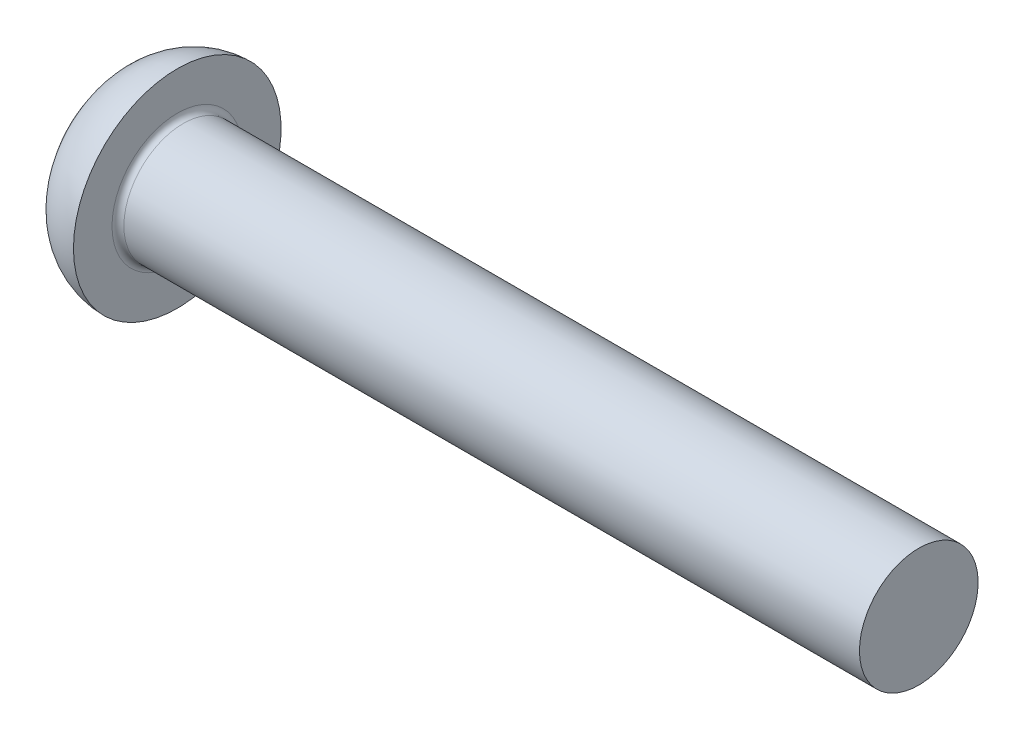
ISO-10303-21;
HEADER;
FILE_DESCRIPTION(('STEP AP214'),'2;1');
FILE_NAME('part.step','',(''),(''),'','','');
FILE_SCHEMA(('AUTOMOTIVE_DESIGN { 1 0 10303 214 1 1 1 1 }'));
ENDSEC;
DATA;
#1=APPLICATION_CONTEXT('core data for automotive mechanical design processes');
#2=APPLICATION_PROTOCOL_DEFINITION('international standard','automotive_design',2000,#1);
#3=PRODUCT_CONTEXT('',#1,'mechanical');
#4=PRODUCT('Part','Part','',(#3));
#5=PRODUCT_RELATED_PRODUCT_CATEGORY('part','',(#4));
#6=PRODUCT_DEFINITION_FORMATION('','',#4);
#7=PRODUCT_DEFINITION_CONTEXT('part definition',#1,'design');
#8=PRODUCT_DEFINITION('design','',#6,#7);
#9=PRODUCT_DEFINITION_SHAPE('','',#8);
#10=(LENGTH_UNIT() NAMED_UNIT(*) SI_UNIT(.MILLI.,.METRE.));
#11=(NAMED_UNIT(*) PLANE_ANGLE_UNIT() SI_UNIT($,.RADIAN.));
#12=(NAMED_UNIT(*) SI_UNIT($,.STERADIAN.) SOLID_ANGLE_UNIT());
#13=UNCERTAINTY_MEASURE_WITH_UNIT(LENGTH_MEASURE(1.E-05),#10,'distance_accuracy_value','');
#14=(GEOMETRIC_REPRESENTATION_CONTEXT(3) GLOBAL_UNCERTAINTY_ASSIGNED_CONTEXT((#13)) GLOBAL_UNIT_ASSIGNED_CONTEXT((#10,
#11,#12)) REPRESENTATION_CONTEXT('',''));
#15=CARTESIAN_POINT('',(0.,0.,0.));
#16=DIRECTION('',(0.,0.,1.));
#17=DIRECTION('',(1.,0.,0.));
#18=AXIS2_PLACEMENT_3D('',#15,#16,#17);
#19=CARTESIAN_POINT('',(8.4,0.,0.));
#20=DIRECTION('',(-1.,0.,0.));
#21=DIRECTION('',(0.,1.,0.));
#22=AXIS2_PLACEMENT_3D('',#19,#20,#21);
#23=SPHERICAL_SURFACE('',#22,8.4);
#24=CARTESIAN_POINT('',(1.88795521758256,0.,0.));
#25=DIRECTION('',(-1.,0.,0.));
#26=DIRECTION('',(0.,0.,1.));
#27=AXIS2_PLACEMENT_3D('',#24,#25,#26);
#28=CIRCLE('',#27,5.30596576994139);
#29=CARTESIAN_POINT('',(1.88795521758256,0.,5.30596576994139));
#30=VERTEX_POINT('',#29);
#31=EDGE_CURVE('E873',#30,#30,#28,.T.);
#32=ORIENTED_EDGE('',*,*,#31,.T.);
#33=EDGE_LOOP('',(#32));
#34=FACE_BOUND('',#33,.T.);
#35=CARTESIAN_POINT('',(0.206025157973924,0.,0.));
#36=DIRECTION('',(1.,0.,0.));
#37=DIRECTION('',(0.,0.,-1.));
#38=AXIS2_PLACEMENT_3D('',#35,#36,#37);
#39=CIRCLE('',#38,1.84899331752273);
#40=CARTESIAN_POINT('',(0.206025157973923,-0.846999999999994,-1.64358367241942));
#41=VERTEX_POINT('',#40);
#42=CARTESIAN_POINT('',(0.206025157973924,-1.64358367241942,-0.847));
#43=VERTEX_POINT('',#42);
#44=EDGE_CURVE('E628',#41,#43,#39,.F.);
#45=ORIENTED_EDGE('',*,*,#44,.F.);
#46=CARTESIAN_POINT('',(8.4,-0.847,0.));
#47=DIRECTION('',(0.,1.,0.));
#48=DIRECTION('',(0.,0.,1.));
#49=AXIS2_PLACEMENT_3D('',#46,#47,#48);
#50=CIRCLE('',#49,8.35718798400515);
#51=CARTESIAN_POINT('',(0.790764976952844,-0.846999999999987,-3.45573919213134));
#52=VERTEX_POINT('',#51);
#53=EDGE_CURVE('E537',#52,#41,#50,.T.);
#54=ORIENTED_EDGE('',*,*,#53,.F.);
#55=CARTESIAN_POINT('',(8.26499674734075,0.,0.270774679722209));
#56=DIRECTION('',(-0.446197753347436,0.,0.894934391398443));
#57=DIRECTION('',(0.894934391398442,0.,0.446197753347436));
#58=AXIS2_PLACEMENT_3D('',#55,#56,#57);
#59=CIRCLE('',#58,8.3945491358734);
#60=CARTESIAN_POINT('',(0.790764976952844,0.847000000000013,-3.45573919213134));
#61=VERTEX_POINT('',#60);
#62=EDGE_CURVE('E67',#61,#52,#59,.T.);
#63=ORIENTED_EDGE('',*,*,#62,.F.);
#64=CARTESIAN_POINT('',(8.4,0.846999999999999,0.));
#65=DIRECTION('',(0.,-1.,0.));
#66=DIRECTION('',(0.,0.,-1.));
#67=AXIS2_PLACEMENT_3D('',#64,#65,#66);
#68=CIRCLE('',#67,8.35718798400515);
#69=CARTESIAN_POINT('',(0.206025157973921,0.847000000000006,-1.64358367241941));
#70=VERTEX_POINT('',#69);
#71=EDGE_CURVE('E529',#70,#61,#68,.T.);
#72=ORIENTED_EDGE('',*,*,#71,.F.);
#73=CARTESIAN_POINT('',(0.206025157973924,1.64358367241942,-0.847));
#74=VERTEX_POINT('',#73);
#75=EDGE_CURVE('E369',#74,#70,#39,.F.);
#76=ORIENTED_EDGE('',*,*,#75,.F.);
#77=CARTESIAN_POINT('',(8.4,0.,-0.846999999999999));
#78=DIRECTION('',(0.,0.,1.));
#79=DIRECTION('',(0.,-1.,0.));
#80=AXIS2_PLACEMENT_3D('',#77,#78,#79);
#81=CIRCLE('',#80,8.35718798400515);
#82=CARTESIAN_POINT('',(0.790764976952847,3.45573919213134,-0.846999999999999));
#83=VERTEX_POINT('',#82);
#84=EDGE_CURVE('E643',#83,#74,#81,.T.);
#85=ORIENTED_EDGE('',*,*,#84,.F.);
#86=CARTESIAN_POINT('',(8.26499674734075,-0.270774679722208,0.));
#87=DIRECTION('',(-0.446197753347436,-0.894934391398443,0.));
#88=DIRECTION('',(0.894934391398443,-0.446197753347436,0.));
#89=AXIS2_PLACEMENT_3D('',#86,#87,#88);
#90=CIRCLE('',#89,8.3945491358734);
#91=CARTESIAN_POINT('',(0.790764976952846,3.45573919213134,0.847000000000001));
#92=VERTEX_POINT('',#91);
#93=EDGE_CURVE('E644',#92,#83,#90,.T.);
#94=ORIENTED_EDGE('',*,*,#93,.F.);
#95=CARTESIAN_POINT('',(8.4,0.,0.847));
#96=DIRECTION('',(0.,0.,-1.));
#97=DIRECTION('',(0.,1.,0.));
#98=AXIS2_PLACEMENT_3D('',#95,#96,#97);
#99=CIRCLE('',#98,8.35718798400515);
#100=CARTESIAN_POINT('',(0.206025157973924,1.64358367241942,0.847));
#101=VERTEX_POINT('',#100);
#102=EDGE_CURVE('E83',#101,#92,#99,.T.);
#103=ORIENTED_EDGE('',*,*,#102,.F.);
#104=CARTESIAN_POINT('',(0.206025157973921,0.846999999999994,1.64358367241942));
#105=VERTEX_POINT('',#104);
#106=EDGE_CURVE('E605',#105,#101,#39,.F.);
#107=ORIENTED_EDGE('',*,*,#106,.F.);
#108=CARTESIAN_POINT('',(0.790764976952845,0.846999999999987,3.45573919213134));
#109=VERTEX_POINT('',#108);
#110=EDGE_CURVE('E541',#109,#105,#68,.T.);
#111=ORIENTED_EDGE('',*,*,#110,.F.);
#112=CARTESIAN_POINT('',(8.26499674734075,0.,-0.270774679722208));
#113=DIRECTION('',(-0.446197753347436,0.,-0.894934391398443));
#114=DIRECTION('',(-0.894934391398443,0.,0.446197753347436));
#115=AXIS2_PLACEMENT_3D('',#112,#113,#114);
#116=CIRCLE('',#115,8.3945491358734);
#117=CARTESIAN_POINT('',(0.790764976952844,-0.847000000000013,3.45573919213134));
#118=VERTEX_POINT('',#117);
#119=EDGE_CURVE('E655',#118,#109,#116,.T.);
#120=ORIENTED_EDGE('',*,*,#119,.F.);
#121=CARTESIAN_POINT('',(0.206025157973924,-0.847000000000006,1.64358367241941));
#122=VERTEX_POINT('',#121);
#123=EDGE_CURVE('E540',#122,#118,#50,.T.);
#124=ORIENTED_EDGE('',*,*,#123,.F.);
#125=CARTESIAN_POINT('',(0.206025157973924,-1.64358367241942,0.847));
#126=VERTEX_POINT('',#125);
#127=EDGE_CURVE('E625',#126,#122,#39,.F.);
#128=ORIENTED_EDGE('',*,*,#127,.F.);
#129=CARTESIAN_POINT('',(0.790764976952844,-3.45573919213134,0.846999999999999));
#130=VERTEX_POINT('',#129);
#131=EDGE_CURVE('E651',#130,#126,#99,.T.);
#132=ORIENTED_EDGE('',*,*,#131,.F.);
#133=CARTESIAN_POINT('',(8.26499674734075,0.270774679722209,0.));
#134=DIRECTION('',(-0.446197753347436,0.894934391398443,0.));
#135=DIRECTION('',(-0.894934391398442,-0.446197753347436,0.));
#136=AXIS2_PLACEMENT_3D('',#133,#134,#135);
#137=CIRCLE('',#136,8.3945491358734);
#138=CARTESIAN_POINT('',(0.790764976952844,-3.45573919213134,-0.847000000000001));
#139=VERTEX_POINT('',#138);
#140=EDGE_CURVE('E642',#139,#130,#137,.T.);
#141=ORIENTED_EDGE('',*,*,#140,.F.);
#142=EDGE_CURVE('E640',#43,#139,#81,.T.);
#143=ORIENTED_EDGE('',*,*,#142,.F.);
#144=EDGE_LOOP('',(#45,#54,#63,#72,#76,#85,#94,#103,#107,#111,#120,#124,#128,#132,#141,#143));
#145=FACE_BOUND('',#144,.T.);
#146=ADVANCED_FACE('F57',(#34,#145),#23,.T.);
#147=CARTESIAN_POINT('',(0.,-3.85,0.846999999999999));
#148=DIRECTION('',(0.,0.,-1.));
#149=DIRECTION('',(0.,1.,0.));
#150=AXIS2_PLACEMENT_3D('',#147,#148,#149);
#151=PLANE('',#150);
#152=ORIENTED_EDGE('',*,*,#131,.T.);
#153=CARTESIAN_POINT('',(0.0856194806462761,-1.65304981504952,0.847));
#154=CARTESIAN_POINT('',(0.662605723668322,-1.60769205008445,0.847));
#155=CARTESIAN_POINT('',(1.23956569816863,-1.56199038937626,0.847));
#156=CARTESIAN_POINT('',(2.39340338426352,-1.46957892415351,0.847));
#157=CARTESIAN_POINT('',(2.97028109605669,-1.42286912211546,0.847));
#158=CARTESIAN_POINT('',(3.78481241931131,-1.35597212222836,0.847));
#159=CARTESIAN_POINT('',(4.02251133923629,-1.33633645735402,0.847));
#160=CARTESIAN_POINT('',(4.2602,-1.31657675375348,0.847));
#161=B_SPLINE_CURVE_WITH_KNOTS('',3,(#153,#154,#155,#156,#157,#158,#159,#160),.UNSPECIFIED.,.F.,
.F.,(4,2,2,4),(0.,1.73630010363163,3.47259594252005,4.18812157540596),.UNSPECIFIED.);
#162=CARTESIAN_POINT('',(4.26,-1.31659338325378,0.847));
#163=VERTEX_POINT('',#162);
#164=EDGE_CURVE('E629',#126,#163,#161,.T.);
#165=ORIENTED_EDGE('',*,*,#164,.T.);
#166=DIRECTION('',(0.,-1.,0.));
#167=VECTOR('',#166,1.);
#168=CARTESIAN_POINT('',(4.26,1.72604270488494,0.847000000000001));
#169=LINE('',#168,#167);
#170=CARTESIAN_POINT('',(4.26,-1.72604270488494,0.847));
#171=VERTEX_POINT('',#170);
#172=EDGE_CURVE('E418',#163,#171,#169,.T.);
#173=ORIENTED_EDGE('',*,*,#172,.T.);
#174=DIRECTION('',(0.894934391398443,0.446197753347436,0.));
#175=VECTOR('',#174,1.);
#176=CARTESIAN_POINT('',(0.,-3.85,0.846999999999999));
#177=LINE('',#176,#175);
#178=EDGE_CURVE('E553',#130,#171,#177,.T.);
#179=ORIENTED_EDGE('',*,*,#178,.F.);
#180=EDGE_LOOP('',(#152,#165,#173,#179));
#181=FACE_BOUND('',#180,.T.);
#182=ADVANCED_FACE('F187',(#181),#151,.T.);
#183=CARTESIAN_POINT('',(4.26,1.72604270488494,0.847000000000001));
#184=VERTEX_POINT('',#183);
#185=CARTESIAN_POINT('',(4.26,1.31659338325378,0.847));
#186=VERTEX_POINT('',#185);
#187=EDGE_CURVE('E572',#184,#186,#169,.T.);
#188=ORIENTED_EDGE('',*,*,#187,.T.);
#189=CARTESIAN_POINT('',(4.2602,1.31657675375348,0.847000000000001));
#190=CARTESIAN_POINT('',(3.77406971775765,1.35698413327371,0.847000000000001));
#191=CARTESIAN_POINT('',(3.28789704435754,1.39687738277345,0.847));
#192=CARTESIAN_POINT('',(2.31548422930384,1.47582372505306,0.847));
#193=CARTESIAN_POINT('',(1.82924408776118,1.5148768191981,0.847));
#194=CARTESIAN_POINT('',(1.13342746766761,1.57029295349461,0.847));
#195=CARTESIAN_POINT('',(0.923872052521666,1.58692142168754,0.847));
#196=CARTESIAN_POINT('',(0.504752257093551,1.62006685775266,0.847));
#197=CARTESIAN_POINT('',(0.295187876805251,1.63658382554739,0.847));
#198=CARTESIAN_POINT('',(0.0856194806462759,1.65304981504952,0.847));
#199=B_SPLINE_CURVE_WITH_KNOTS('',3,(#189,#190,#191,#192,#193,#194,#195,#196,#197,#198),
.UNSPECIFIED.,.F.,.F.,(4,2,2,2,4),(0.,1.46341944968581,2.92683652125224,3.55747887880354,
4.18812167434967),.UNSPECIFIED.);
#200=EDGE_CURVE('E624',#186,#101,#199,.T.);
#201=ORIENTED_EDGE('',*,*,#200,.T.);
#202=ORIENTED_EDGE('',*,*,#102,.T.);
#203=DIRECTION('',(0.894934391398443,-0.446197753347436,0.));
#204=VECTOR('',#203,1.);
#205=CARTESIAN_POINT('',(0.,3.85,0.847000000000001));
#206=LINE('',#205,#204);
#207=EDGE_CURVE('E550',#92,#184,#206,.T.);
#208=ORIENTED_EDGE('',*,*,#207,.T.);
#209=EDGE_LOOP('',(#188,#201,#202,#208));
#210=FACE_BOUND('',#209,.T.);
#211=ADVANCED_FACE('F193',(#210),#151,.T.);
#212=CARTESIAN_POINT('',(0.,3.85,-0.846999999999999));
#213=DIRECTION('',(0.,0.,1.));
#214=DIRECTION('',(0.,-1.,0.));
#215=AXIS2_PLACEMENT_3D('',#212,#213,#214);
#216=PLANE('',#215);
#217=DIRECTION('',(0.,1.,0.));
#218=VECTOR('',#217,1.);
#219=CARTESIAN_POINT('',(4.26,1.72604270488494,-0.846999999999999));
#220=LINE('',#219,#218);
#221=CARTESIAN_POINT('',(4.26,-1.72604270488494,-0.846999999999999));
#222=VERTEX_POINT('',#221);
#223=CARTESIAN_POINT('',(4.26,-1.31659338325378,-0.846999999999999));
#224=VERTEX_POINT('',#223);
#225=EDGE_CURVE('E570',#222,#224,#220,.T.);
#226=ORIENTED_EDGE('',*,*,#225,.T.);
#227=CARTESIAN_POINT('',(4.2602,-1.31657675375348,-0.847));
#228=CARTESIAN_POINT('',(3.77406971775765,-1.35698413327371,-0.847));
#229=CARTESIAN_POINT('',(3.28789704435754,-1.39687738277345,-0.847));
#230=CARTESIAN_POINT('',(2.31548422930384,-1.47582372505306,-0.847));
#231=CARTESIAN_POINT('',(1.82924408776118,-1.5148768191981,-0.847));
#232=CARTESIAN_POINT('',(1.13342746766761,-1.57029295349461,-0.847));
#233=CARTESIAN_POINT('',(0.923872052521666,-1.58692142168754,-0.847));
#234=CARTESIAN_POINT('',(0.504752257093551,-1.62006685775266,-0.847));
#235=CARTESIAN_POINT('',(0.295187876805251,-1.63658382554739,-0.847));
#236=CARTESIAN_POINT('',(0.0856194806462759,-1.65304981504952,-0.847));
#237=B_SPLINE_CURVE_WITH_KNOTS('',3,(#227,#228,#229,#230,#231,#232,#233,#234,#235,#236),
.UNSPECIFIED.,.F.,.F.,(4,2,2,2,4),(0.,1.46341944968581,2.92683652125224,3.55747887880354,
4.18812167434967),.UNSPECIFIED.);
#238=EDGE_CURVE('E633',#224,#43,#237,.T.);
#239=ORIENTED_EDGE('',*,*,#238,.T.);
#240=ORIENTED_EDGE('',*,*,#142,.T.);
#241=DIRECTION('',(0.894934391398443,0.446197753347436,0.));
#242=VECTOR('',#241,1.);
#243=CARTESIAN_POINT('',(0.,-3.85,-0.847000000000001));
#244=LINE('',#243,#242);
#245=EDGE_CURVE('E549',#139,#222,#244,.T.);
#246=ORIENTED_EDGE('',*,*,#245,.T.);
#247=EDGE_LOOP('',(#226,#239,#240,#246));
#248=FACE_BOUND('',#247,.T.);
#249=ADVANCED_FACE('F378',(#248),#216,.T.);
#250=ORIENTED_EDGE('',*,*,#84,.T.);
#251=CARTESIAN_POINT('',(0.0856194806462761,1.65304981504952,-0.847));
#252=CARTESIAN_POINT('',(0.662605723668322,1.60769205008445,-0.847));
#253=CARTESIAN_POINT('',(1.23956569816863,1.56199038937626,-0.847));
#254=CARTESIAN_POINT('',(2.39340338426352,1.46957892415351,-0.847));
#255=CARTESIAN_POINT('',(2.97028109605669,1.42286912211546,-0.847));
#256=CARTESIAN_POINT('',(3.78481241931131,1.35597212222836,-0.847));
#257=CARTESIAN_POINT('',(4.02251133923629,1.33633645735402,-0.847));
#258=CARTESIAN_POINT('',(4.2602,1.31657675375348,-0.847));
#259=B_SPLINE_CURVE_WITH_KNOTS('',3,(#251,#252,#253,#254,#255,#256,#257,#258),.UNSPECIFIED.,.F.,
.F.,(4,2,2,4),(0.,1.73630010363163,3.47259594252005,4.18812157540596),.UNSPECIFIED.);
#260=CARTESIAN_POINT('',(4.26,1.31659338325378,-0.846999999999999));
#261=VERTEX_POINT('',#260);
#262=EDGE_CURVE('E366',#74,#261,#259,.T.);
#263=ORIENTED_EDGE('',*,*,#262,.T.);
#264=CARTESIAN_POINT('',(4.26,1.72604270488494,-0.846999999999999));
#265=VERTEX_POINT('',#264);
#266=EDGE_CURVE('E406',#261,#265,#220,.T.);
#267=ORIENTED_EDGE('',*,*,#266,.T.);
#268=DIRECTION('',(0.894934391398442,-0.446197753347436,0.));
#269=VECTOR('',#268,1.);
#270=CARTESIAN_POINT('',(0.,3.85,-0.846999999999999));
#271=LINE('',#270,#269);
#272=EDGE_CURVE('E547',#83,#265,#271,.T.);
#273=ORIENTED_EDGE('',*,*,#272,.F.);
#274=EDGE_LOOP('',(#250,#263,#267,#273));
#275=FACE_BOUND('',#274,.T.);
#276=ADVANCED_FACE('F221',(#275),#216,.T.);
#277=CARTESIAN_POINT('',(4.26,-1.72604270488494,0.847));
#278=DIRECTION('',(1.,0.,0.));
#279=DIRECTION('',(0.,0.,-1.));
#280=AXIS2_PLACEMENT_3D('',#277,#278,#279);
#281=PLANE('',#280);
#282=CARTESIAN_POINT('',(4.26,0.,0.));
#283=DIRECTION('',(-1.,0.,0.));
#284=DIRECTION('',(0.,0.,1.));
#285=AXIS2_PLACEMENT_3D('',#282,#283,#284);
#286=CIRCLE('',#285,1.56551178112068);
#287=EDGE_CURVE('E581',#224,#163,#286,.T.);
#288=ORIENTED_EDGE('',*,*,#287,.F.);
#289=ORIENTED_EDGE('',*,*,#225,.F.);
#290=DIRECTION('',(0.,0.,-1.));
#291=VECTOR('',#290,1.);
#292=CARTESIAN_POINT('',(4.26,-1.72604270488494,0.847));
#293=LINE('',#292,#291);
#294=EDGE_CURVE('E437',#171,#222,#293,.T.);
#295=ORIENTED_EDGE('',*,*,#294,.F.);
#296=ORIENTED_EDGE('',*,*,#172,.F.);
#297=EDGE_LOOP('',(#288,#289,#295,#296));
#298=FACE_BOUND('',#297,.T.);
#299=ADVANCED_FACE('F216',(#298),#281,.F.);
#300=CARTESIAN_POINT('',(4.26,-0.847000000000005,1.31659338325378));
#301=VERTEX_POINT('',#300);
#302=CARTESIAN_POINT('',(4.26,0.846999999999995,1.31659338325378));
#303=VERTEX_POINT('',#302);
#304=EDGE_CURVE('E597',#301,#303,#286,.T.);
#305=ORIENTED_EDGE('',*,*,#304,.F.);
#306=DIRECTION('',(0.,0.,-1.));
#307=VECTOR('',#306,1.);
#308=CARTESIAN_POINT('',(4.26,-0.847000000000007,1.72604270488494));
#309=LINE('',#308,#307);
#310=CARTESIAN_POINT('',(4.26,-0.847000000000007,1.72604270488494));
#311=VERTEX_POINT('',#310);
#312=EDGE_CURVE('E61',#311,#301,#309,.T.);
#313=ORIENTED_EDGE('',*,*,#312,.F.);
#314=DIRECTION('',(0.,-1.,0.));
#315=VECTOR('',#314,1.);
#316=CARTESIAN_POINT('',(4.26,-0.847000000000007,1.72604270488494));
#317=LINE('',#316,#315);
#318=CARTESIAN_POINT('',(4.26,0.846999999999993,1.72604270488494));
#319=VERTEX_POINT('',#318);
#320=EDGE_CURVE('E510',#319,#311,#317,.T.);
#321=ORIENTED_EDGE('',*,*,#320,.F.);
#322=DIRECTION('',(0.,0.,1.));
#323=VECTOR('',#322,1.);
#324=CARTESIAN_POINT('',(4.26,0.846999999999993,1.72604270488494));
#325=LINE('',#324,#323);
#326=EDGE_CURVE('E295',#303,#319,#325,.T.);
#327=ORIENTED_EDGE('',*,*,#326,.F.);
#328=EDGE_LOOP('',(#305,#313,#321,#327));
#329=FACE_BOUND('',#328,.T.);
#330=ADVANCED_FACE('F220',(#329),#281,.F.);
#331=EDGE_CURVE('E575',#186,#261,#286,.T.);
#332=ORIENTED_EDGE('',*,*,#331,.F.);
#333=ORIENTED_EDGE('',*,*,#187,.F.);
#334=DIRECTION('',(0.,0.,1.));
#335=VECTOR('',#334,1.);
#336=CARTESIAN_POINT('',(4.26,1.72604270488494,0.847000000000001));
#337=LINE('',#336,#335);
#338=EDGE_CURVE('E560',#265,#184,#337,.T.);
#339=ORIENTED_EDGE('',*,*,#338,.F.);
#340=ORIENTED_EDGE('',*,*,#266,.F.);
#341=EDGE_LOOP('',(#332,#333,#339,#340));
#342=FACE_BOUND('',#341,.T.);
#343=ADVANCED_FACE('F573',(#342),#281,.F.);
#344=CARTESIAN_POINT('',(4.26,0.847000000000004,-1.31659338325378));
#345=VERTEX_POINT('',#344);
#346=CARTESIAN_POINT('',(4.26,-0.846999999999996,-1.31659338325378));
#347=VERTEX_POINT('',#346);
#348=EDGE_CURVE('E506',#345,#347,#286,.T.);
#349=ORIENTED_EDGE('',*,*,#348,.F.);
#350=CARTESIAN_POINT('',(4.26,0.847000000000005,-1.72604270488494));
#351=VERTEX_POINT('',#350);
#352=EDGE_CURVE('E503',#351,#345,#325,.T.);
#353=ORIENTED_EDGE('',*,*,#352,.F.);
#354=DIRECTION('',(0.,1.,0.));
#355=VECTOR('',#354,1.);
#356=CARTESIAN_POINT('',(4.26,-0.846999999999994,-1.72604270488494));
#357=LINE('',#356,#355);
#358=CARTESIAN_POINT('',(4.26,-0.846999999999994,-1.72604270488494));
#359=VERTEX_POINT('',#358);
#360=EDGE_CURVE('E504',#359,#351,#357,.T.);
#361=ORIENTED_EDGE('',*,*,#360,.F.);
#362=EDGE_CURVE('E368',#347,#359,#309,.T.);
#363=ORIENTED_EDGE('',*,*,#362,.F.);
#364=EDGE_LOOP('',(#349,#353,#361,#363));
#365=FACE_BOUND('',#364,.T.);
#366=ADVANCED_FACE('F223',(#365),#281,.F.);
#367=CARTESIAN_POINT('',(0.,0.846999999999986,3.85));
#368=DIRECTION('',(0.,-1.,0.));
#369=DIRECTION('',(0.,0.,-1.));
#370=AXIS2_PLACEMENT_3D('',#367,#368,#369);
#371=PLANE('',#370);
#372=ORIENTED_EDGE('',*,*,#352,.T.);
#373=CARTESIAN_POINT('',(4.2602,0.847000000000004,-1.31657675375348));
#374=CARTESIAN_POINT('',(3.77406971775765,0.847000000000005,-1.35698413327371));
#375=CARTESIAN_POINT('',(3.28789704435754,0.847000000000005,-1.39687738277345));
#376=CARTESIAN_POINT('',(2.31548422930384,0.847000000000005,-1.47582372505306));
#377=CARTESIAN_POINT('',(1.82924408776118,0.847000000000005,-1.5148768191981));
#378=CARTESIAN_POINT('',(1.13342746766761,0.847000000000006,-1.57029295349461));
#379=CARTESIAN_POINT('',(0.923872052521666,0.847000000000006,-1.58692142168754));
#380=CARTESIAN_POINT('',(0.504752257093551,0.847000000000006,-1.62006685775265));
#381=CARTESIAN_POINT('',(0.295187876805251,0.847000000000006,-1.63658382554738));
#382=CARTESIAN_POINT('',(0.0856194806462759,0.847000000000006,-1.65304981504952));
#383=B_SPLINE_CURVE_WITH_KNOTS('',3,(#373,#374,#375,#376,#377,#378,#379,#380,#381,#382),
.UNSPECIFIED.,.F.,.F.,(4,2,2,2,4),(0.,1.46341944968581,2.92683652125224,3.55747887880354,
4.18812167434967),.UNSPECIFIED.);
#384=EDGE_CURVE('E365',#345,#70,#383,.T.);
#385=ORIENTED_EDGE('',*,*,#384,.T.);
#386=ORIENTED_EDGE('',*,*,#71,.T.);
#387=DIRECTION('',(0.894934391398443,0.,0.446197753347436));
#388=VECTOR('',#387,1.);
#389=CARTESIAN_POINT('',(0.,0.847000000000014,-3.85));
#390=LINE('',#389,#388);
#391=EDGE_CURVE('E515',#61,#351,#390,.T.);
#392=ORIENTED_EDGE('',*,*,#391,.T.);
#393=EDGE_LOOP('',(#372,#385,#386,#392));
#394=FACE_BOUND('',#393,.T.);
#395=ADVANCED_FACE('F306',(#394),#371,.T.);
#396=CARTESIAN_POINT('',(0.,-0.846999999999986,-3.85));
#397=DIRECTION('',(0.,1.,0.));
#398=DIRECTION('',(0.,0.,1.));
#399=AXIS2_PLACEMENT_3D('',#396,#397,#398);
#400=PLANE('',#399);
#401=ORIENTED_EDGE('',*,*,#53,.T.);
#402=CARTESIAN_POINT('',(0.0856194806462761,-0.846999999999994,-1.65304981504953));
#403=CARTESIAN_POINT('',(0.66260572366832,-0.846999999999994,-1.60769205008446));
#404=CARTESIAN_POINT('',(1.23956569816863,-0.846999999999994,-1.56199038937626));
#405=CARTESIAN_POINT('',(2.39340338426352,-0.846999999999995,-1.46957892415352));
#406=CARTESIAN_POINT('',(2.97028109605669,-0.846999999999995,-1.42286912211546));
#407=CARTESIAN_POINT('',(3.78481241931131,-0.846999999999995,-1.35597212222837));
#408=CARTESIAN_POINT('',(4.02251133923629,-0.846999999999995,-1.33633645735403));
#409=CARTESIAN_POINT('',(4.2602,-0.846999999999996,-1.31657675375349));
#410=B_SPLINE_CURVE_WITH_KNOTS('',3,(#402,#403,#404,#405,#406,#407,#408,#409),.UNSPECIFIED.,.F.,
.F.,(4,2,2,4),(0.,1.73630010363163,3.47259594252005,4.18812157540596),.UNSPECIFIED.);
#411=EDGE_CURVE('E632',#41,#347,#410,.T.);
#412=ORIENTED_EDGE('',*,*,#411,.T.);
#413=ORIENTED_EDGE('',*,*,#362,.T.);
#414=DIRECTION('',(0.894934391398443,0.,0.446197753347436));
#415=VECTOR('',#414,1.);
#416=CARTESIAN_POINT('',(0.,-0.846999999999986,-3.85));
#417=LINE('',#416,#415);
#418=EDGE_CURVE('E518',#52,#359,#417,.T.);
#419=ORIENTED_EDGE('',*,*,#418,.F.);
#420=EDGE_LOOP('',(#401,#412,#413,#419));
#421=FACE_BOUND('',#420,.T.);
#422=ADVANCED_FACE('F474',(#421),#400,.T.);
#423=ORIENTED_EDGE('',*,*,#312,.T.);
#424=CARTESIAN_POINT('',(4.2602,-0.847000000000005,1.31657675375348));
#425=CARTESIAN_POINT('',(3.77406971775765,-0.847000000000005,1.3569841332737));
#426=CARTESIAN_POINT('',(3.28789704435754,-0.847000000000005,1.39687738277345));
#427=CARTESIAN_POINT('',(2.31548422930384,-0.847000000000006,1.47582372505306));
#428=CARTESIAN_POINT('',(1.82924408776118,-0.847000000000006,1.5148768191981));
#429=CARTESIAN_POINT('',(1.13342746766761,-0.847000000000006,1.57029295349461));
#430=CARTESIAN_POINT('',(0.923872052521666,-0.847000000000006,1.58692142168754));
#431=CARTESIAN_POINT('',(0.504752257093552,-0.847000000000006,1.62006685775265));
#432=CARTESIAN_POINT('',(0.295187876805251,-0.847000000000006,1.63658382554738));
#433=CARTESIAN_POINT('',(0.0856194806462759,-0.847000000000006,1.65304981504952));
#434=B_SPLINE_CURVE_WITH_KNOTS('',3,(#424,#425,#426,#427,#428,#429,#430,#431,#432,#433),
.UNSPECIFIED.,.F.,.F.,(4,2,2,2,4),(0.,1.46341944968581,2.92683652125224,3.55747887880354,
4.18812167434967),.UNSPECIFIED.);
#435=EDGE_CURVE('E627',#301,#122,#434,.T.);
#436=ORIENTED_EDGE('',*,*,#435,.T.);
#437=ORIENTED_EDGE('',*,*,#123,.T.);
#438=DIRECTION('',(0.894934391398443,0.,-0.446197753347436));
#439=VECTOR('',#438,1.);
#440=CARTESIAN_POINT('',(0.,-0.847000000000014,3.85));
#441=LINE('',#440,#439);
#442=EDGE_CURVE('E527',#118,#311,#441,.T.);
#443=ORIENTED_EDGE('',*,*,#442,.T.);
#444=EDGE_LOOP('',(#423,#436,#437,#443));
#445=FACE_BOUND('',#444,.T.);
#446=ADVANCED_FACE('F482',(#445),#400,.T.);
#447=ORIENTED_EDGE('',*,*,#110,.T.);
#448=CARTESIAN_POINT('',(0.0856194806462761,0.846999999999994,1.65304981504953));
#449=CARTESIAN_POINT('',(0.662605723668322,0.846999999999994,1.60769205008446));
#450=CARTESIAN_POINT('',(1.23956569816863,0.846999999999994,1.56199038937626));
#451=CARTESIAN_POINT('',(2.39340338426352,0.846999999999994,1.46957892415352));
#452=CARTESIAN_POINT('',(2.97028109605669,0.846999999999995,1.42286912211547));
#453=CARTESIAN_POINT('',(3.78481241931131,0.846999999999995,1.35597212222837));
#454=CARTESIAN_POINT('',(4.02251133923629,0.846999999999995,1.33633645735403));
#455=CARTESIAN_POINT('',(4.2602,0.846999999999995,1.31657675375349));
#456=B_SPLINE_CURVE_WITH_KNOTS('',3,(#448,#449,#450,#451,#452,#453,#454,#455),.UNSPECIFIED.,.F.,
.F.,(4,2,2,4),(0.,1.73630010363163,3.47259594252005,4.18812157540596),.UNSPECIFIED.);
#457=EDGE_CURVE('E12',#105,#303,#456,.T.);
#458=ORIENTED_EDGE('',*,*,#457,.T.);
#459=ORIENTED_EDGE('',*,*,#326,.T.);
#460=DIRECTION('',(0.894934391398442,0.,-0.446197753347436));
#461=VECTOR('',#460,1.);
#462=CARTESIAN_POINT('',(0.,0.846999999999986,3.85));
#463=LINE('',#462,#461);
#464=EDGE_CURVE('E524',#109,#319,#463,.T.);
#465=ORIENTED_EDGE('',*,*,#464,.F.);
#466=EDGE_LOOP('',(#447,#458,#459,#465));
#467=FACE_BOUND('',#466,.T.);
#468=ADVANCED_FACE('F203',(#467),#371,.T.);
#469=CARTESIAN_POINT('',(55.4,4.,0.));
#470=DIRECTION('',(-1.,0.,0.));
#471=DIRECTION('',(0.,0.,1.));
#472=AXIS2_PLACEMENT_3D('',#469,#470,#471);
#473=PLANE('',#472);
#474=CARTESIAN_POINT('',(55.4,0.,0.));
#475=DIRECTION('',(-1.,0.,0.));
#476=DIRECTION('',(0.,0.,1.));
#477=AXIS2_PLACEMENT_3D('',#474,#475,#476);
#478=CIRCLE('',#477,4.);
#479=CARTESIAN_POINT('',(55.4,0.,4.));
#480=VERTEX_POINT('',#479);
#481=EDGE_CURVE('E866',#480,#480,#478,.T.);
#482=ORIENTED_EDGE('',*,*,#481,.F.);
#483=EDGE_LOOP('',(#482));
#484=FACE_BOUND('',#483,.T.);
#485=ADVANCED_FACE('F199',(#484),#473,.F.);
#486=CARTESIAN_POINT('',(0.,0.,0.));
#487=DIRECTION('',(-1.,0.,0.));
#488=DIRECTION('',(0.,0.,1.));
#489=AXIS2_PLACEMENT_3D('',#486,#487,#488);
#490=CYLINDRICAL_SURFACE('',#489,4.);
#491=CARTESIAN_POINT('',(5.8,0.,0.));
#492=DIRECTION('',(-1.,0.,0.));
#493=DIRECTION('',(0.,0.,1.));
#494=AXIS2_PLACEMENT_3D('',#491,#492,#493);
#495=CIRCLE('',#494,4.);
#496=CARTESIAN_POINT('',(5.8,0.,4.));
#497=VERTEX_POINT('',#496);
#498=EDGE_CURVE('E647',#497,#497,#495,.F.);
#499=ORIENTED_EDGE('',*,*,#498,.T.);
#500=EDGE_LOOP('',(#499));
#501=FACE_BOUND('',#500,.T.);
#502=ORIENTED_EDGE('',*,*,#481,.T.);
#503=EDGE_LOOP('',(#502));
#504=FACE_BOUND('',#503,.T.);
#505=ADVANCED_FACE('F202',(#501,#504),#490,.T.);
#506=CARTESIAN_POINT('',(5.4,4.,0.));
#507=DIRECTION('',(-1.,0.,0.));
#508=DIRECTION('',(0.,0.,1.));
#509=AXIS2_PLACEMENT_3D('',#506,#507,#508);
#510=PLANE('',#509);
#511=CARTESIAN_POINT('',(5.4,0.,0.));
#512=DIRECTION('',(-1.,0.,0.));
#513=DIRECTION('',(0.,0.,1.));
#514=AXIS2_PLACEMENT_3D('',#511,#512,#513);
#515=CIRCLE('',#514,4.4);
#516=CARTESIAN_POINT('',(5.4,0.,4.4));
#517=VERTEX_POINT('',#516);
#518=EDGE_CURVE('E865',#517,#517,#515,.T.);
#519=ORIENTED_EDGE('',*,*,#518,.T.);
#520=EDGE_LOOP('',(#519));
#521=FACE_BOUND('',#520,.T.);
#522=CARTESIAN_POINT('',(5.4,0.,0.));
#523=DIRECTION('',(-1.,0.,0.));
#524=DIRECTION('',(0.,0.,1.));
#525=AXIS2_PLACEMENT_3D('',#522,#523,#524);
#526=CIRCLE('',#525,7.);
#527=CARTESIAN_POINT('',(5.4,0.,7.));
#528=VERTEX_POINT('',#527);
#529=EDGE_CURVE('E869',#528,#528,#526,.T.);
#530=ORIENTED_EDGE('',*,*,#529,.F.);
#531=EDGE_LOOP('',(#530));
#532=FACE_BOUND('',#531,.T.);
#533=ADVANCED_FACE('F207',(#521,#532),#510,.F.);
#534=CARTESIAN_POINT('',(5.45407497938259,0.,0.));
#535=DIRECTION('',(-1.,0.,0.));
#536=DIRECTION('',(0.,0.,1.));
#537=AXIS2_PLACEMENT_3D('',#534,#535,#536);
#538=DEGENERATE_TOROIDAL_SURFACE('',#537,2.40031784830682,4.6,.T.);
#539=ORIENTED_EDGE('',*,*,#31,.F.);
#540=EDGE_LOOP('',(#539));
#541=FACE_BOUND('',#540,.T.);
#542=ORIENTED_EDGE('',*,*,#529,.T.);
#543=EDGE_LOOP('',(#542));
#544=FACE_BOUND('',#543,.T.);
#545=ADVANCED_FACE('F211',(#541,#544),#538,.T.);
#546=CARTESIAN_POINT('',(5.8,0.,0.));
#547=DIRECTION('',(-1.,0.,0.));
#548=DIRECTION('',(0.,0.,1.));
#549=AXIS2_PLACEMENT_3D('',#546,#547,#548);
#550=TOROIDAL_SURFACE('',#549,4.4,0.4);
#551=ORIENTED_EDGE('',*,*,#498,.F.);
#552=EDGE_LOOP('',(#551));
#553=FACE_BOUND('',#552,.T.);
#554=ORIENTED_EDGE('',*,*,#518,.F.);
#555=EDGE_LOOP('',(#554));
#556=FACE_BOUND('',#555,.T.);
#557=ADVANCED_FACE('F59',(#553,#556),#550,.F.);
#558=CARTESIAN_POINT('',(4.26,-1.72604270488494,-0.846999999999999));
#559=DIRECTION('',(-0.446197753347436,0.894934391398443,0.));
#560=DIRECTION('',(-0.894934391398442,-0.446197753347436,0.));
#561=AXIS2_PLACEMENT_3D('',#558,#559,#560);
#562=PLANE('',#561);
#563=ORIENTED_EDGE('',*,*,#140,.T.);
#564=ORIENTED_EDGE('',*,*,#178,.T.);
#565=ORIENTED_EDGE('',*,*,#294,.T.);
#566=ORIENTED_EDGE('',*,*,#245,.F.);
#567=EDGE_LOOP('',(#563,#564,#565,#566));
#568=FACE_BOUND('',#567,.T.);
#569=ADVANCED_FACE('F440',(#568),#562,.T.);
#570=CARTESIAN_POINT('',(4.26,1.72604270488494,0.847000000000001));
#571=DIRECTION('',(-0.446197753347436,-0.894934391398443,0.));
#572=DIRECTION('',(0.894934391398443,-0.446197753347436,0.));
#573=AXIS2_PLACEMENT_3D('',#570,#571,#572);
#574=PLANE('',#573);
#575=ORIENTED_EDGE('',*,*,#93,.T.);
#576=ORIENTED_EDGE('',*,*,#272,.T.);
#577=ORIENTED_EDGE('',*,*,#338,.T.);
#578=ORIENTED_EDGE('',*,*,#207,.F.);
#579=EDGE_LOOP('',(#575,#576,#577,#578));
#580=FACE_BOUND('',#579,.T.);
#581=ADVANCED_FACE('F224',(#580),#574,.T.);
#582=CARTESIAN_POINT('',(4.26,0.847000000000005,-1.72604270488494));
#583=DIRECTION('',(-0.446197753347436,0.,0.894934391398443));
#584=DIRECTION('',(-0.894934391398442,0.,-0.446197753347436));
#585=AXIS2_PLACEMENT_3D('',#582,#583,#584);
#586=PLANE('',#585);
#587=ORIENTED_EDGE('',*,*,#62,.T.);
#588=ORIENTED_EDGE('',*,*,#418,.T.);
#589=ORIENTED_EDGE('',*,*,#360,.T.);
#590=ORIENTED_EDGE('',*,*,#391,.F.);
#591=EDGE_LOOP('',(#587,#588,#589,#590));
#592=FACE_BOUND('',#591,.T.);
#593=ADVANCED_FACE('F312',(#592),#586,.T.);
#594=CARTESIAN_POINT('',(4.26,-0.847000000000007,1.72604270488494));
#595=DIRECTION('',(-0.446197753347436,0.,-0.894934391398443));
#596=DIRECTION('',(0.894934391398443,0.,-0.446197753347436));
#597=AXIS2_PLACEMENT_3D('',#594,#595,#596);
#598=PLANE('',#597);
#599=ORIENTED_EDGE('',*,*,#119,.T.);
#600=ORIENTED_EDGE('',*,*,#464,.T.);
#601=ORIENTED_EDGE('',*,*,#320,.T.);
#602=ORIENTED_EDGE('',*,*,#442,.F.);
#603=EDGE_LOOP('',(#599,#600,#601,#602));
#604=FACE_BOUND('',#603,.T.);
#605=ADVANCED_FACE('F448',(#604),#598,.T.);
#606=CARTESIAN_POINT('',(4.26,0.,0.));
#607=DIRECTION('',(-1.,0.,0.));
#608=DIRECTION('',(0.,0.,1.));
#609=AXIS2_PLACEMENT_3D('',#606,#607,#608);
#610=CONICAL_SURFACE('',#609,1.56551178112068,0.0698131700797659);
#611=ORIENTED_EDGE('',*,*,#75,.T.);
#612=ORIENTED_EDGE('',*,*,#384,.F.);
#613=EDGE_CURVE('E615',#261,#345,#286,.T.);
#614=ORIENTED_EDGE('',*,*,#613,.F.);
#615=ORIENTED_EDGE('',*,*,#262,.F.);
#616=EDGE_LOOP('',(#611,#612,#614,#615));
#617=FACE_BOUND('',#616,.T.);
#618=ADVANCED_FACE('F185',(#617),#610,.F.);
#619=EDGE_CURVE('E620',#347,#224,#286,.T.);
#620=ORIENTED_EDGE('',*,*,#619,.F.);
#621=ORIENTED_EDGE('',*,*,#411,.F.);
#622=ORIENTED_EDGE('',*,*,#44,.T.);
#623=ORIENTED_EDGE('',*,*,#238,.F.);
#624=EDGE_LOOP('',(#620,#621,#622,#623));
#625=FACE_BOUND('',#624,.T.);
#626=ADVANCED_FACE('F637',(#625),#610,.F.);
#627=ORIENTED_EDGE('',*,*,#127,.T.);
#628=ORIENTED_EDGE('',*,*,#435,.F.);
#629=EDGE_CURVE('E599',#163,#301,#286,.T.);
#630=ORIENTED_EDGE('',*,*,#629,.F.);
#631=ORIENTED_EDGE('',*,*,#164,.F.);
#632=EDGE_LOOP('',(#627,#628,#630,#631));
#633=FACE_BOUND('',#632,.T.);
#634=ADVANCED_FACE('F183',(#633),#610,.F.);
#635=EDGE_CURVE('E75',#303,#186,#286,.T.);
#636=ORIENTED_EDGE('',*,*,#635,.F.);
#637=ORIENTED_EDGE('',*,*,#457,.F.);
#638=ORIENTED_EDGE('',*,*,#106,.T.);
#639=ORIENTED_EDGE('',*,*,#200,.F.);
#640=EDGE_LOOP('',(#636,#637,#638,#639));
#641=FACE_BOUND('',#640,.T.);
#642=ADVANCED_FACE('F177',(#641),#610,.F.);
#643=CARTESIAN_POINT('',(4.76866561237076,0.,0.));
#644=DIRECTION('',(-1.,0.,0.));
#645=DIRECTION('',(0.,0.,1.));
#646=AXIS2_PLACEMENT_3D('',#643,#644,#645);
#647=CONICAL_SURFACE('',#646,0.,1.25663706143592);
#648=ORIENTED_EDGE('',*,*,#635,.T.);
#649=ORIENTED_EDGE('',*,*,#331,.T.);
#650=ORIENTED_EDGE('',*,*,#613,.T.);
#651=ORIENTED_EDGE('',*,*,#348,.T.);
#652=ORIENTED_EDGE('',*,*,#619,.T.);
#653=ORIENTED_EDGE('',*,*,#287,.T.);
#654=ORIENTED_EDGE('',*,*,#629,.T.);
#655=ORIENTED_EDGE('',*,*,#304,.T.);
#656=EDGE_LOOP('',(#648,#649,#650,#651,#652,#653,#654,#655));
#657=FACE_BOUND('',#656,.T.);
#658=CARTESIAN_POINT('',(4.76866561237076,0.,0.));
#659=VERTEX_POINT('',#658);
#660=VERTEX_LOOP('',#659);
#661=FACE_BOUND('',#660,.T.);
#662=ADVANCED_FACE('F175',(#657,#661),#647,.F.);
#663=CLOSED_SHELL('',(#146,#182,#211,#249,#276,#299,#330,#343,#366,#395,#422,#446,#468,#485,
#505,#533,#545,#557,#569,#581,#593,#605,#618,#626,#634,#642,#662));
#664=MANIFOLD_SOLID_BREP('B2',#663);
#665=ADVANCED_BREP_SHAPE_REPRESENTATION('',(#18,#664),#14);
#666=SHAPE_DEFINITION_REPRESENTATION(#9,#665);
ENDSEC;
END-ISO-10303-21;
